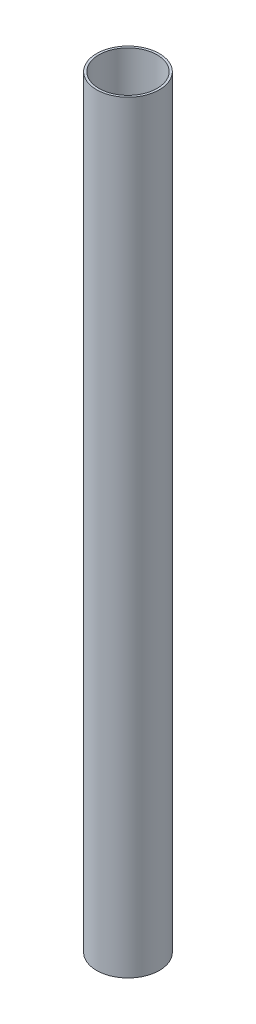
from build123d import *

# Parameters (mm, degrees)
SKETCH1_R           = 18.8087
SKETCH1_R_2         = 17.4625
BOSS_EXTRUDE1_DEPTH = 457.2


with BuildPart() as part:
    # Sketch1 → Boss-Extrude1 (new body)
    with BuildSketch(Plane(origin=(0, 0, 0), x_dir=(1, 0, 0), z_dir=(0, 1, 0))):
        with Locations(Location((0, 0, 0), (0, 0, 270))):
            Circle(SKETCH1_R)
        with Locations(Location((0, 0, 0), (0, 0, 270))):
            Circle(SKETCH1_R_2, mode=Mode.SUBTRACT)
    extrude(amount=BOSS_EXTRUDE1_DEPTH)


solid = part.part
